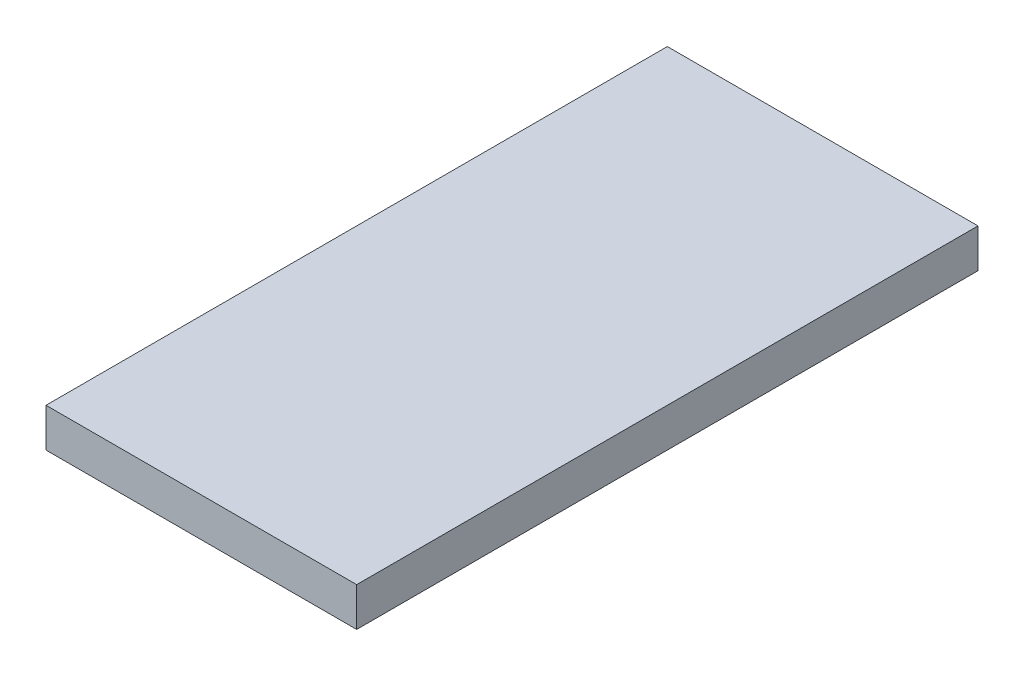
ISO-10303-21;
HEADER;
FILE_DESCRIPTION(('STEP AP214'),'2;1');
FILE_NAME('part.step','',(''),(''),'','','');
FILE_SCHEMA(('AUTOMOTIVE_DESIGN { 1 0 10303 214 1 1 1 1 }'));
ENDSEC;
DATA;
#1=APPLICATION_CONTEXT('core data for automotive mechanical design processes');
#2=APPLICATION_PROTOCOL_DEFINITION('international standard','automotive_design',2000,#1);
#3=PRODUCT_CONTEXT('',#1,'mechanical');
#4=PRODUCT('Part','Part','',(#3));
#5=PRODUCT_RELATED_PRODUCT_CATEGORY('part','',(#4));
#6=PRODUCT_DEFINITION_FORMATION('','',#4);
#7=PRODUCT_DEFINITION_CONTEXT('part definition',#1,'design');
#8=PRODUCT_DEFINITION('design','',#6,#7);
#9=PRODUCT_DEFINITION_SHAPE('','',#8);
#10=(LENGTH_UNIT() NAMED_UNIT(*) SI_UNIT(.MILLI.,.METRE.));
#11=(NAMED_UNIT(*) PLANE_ANGLE_UNIT() SI_UNIT($,.RADIAN.));
#12=(NAMED_UNIT(*) SI_UNIT($,.STERADIAN.) SOLID_ANGLE_UNIT());
#13=UNCERTAINTY_MEASURE_WITH_UNIT(LENGTH_MEASURE(1.E-05),#10,'distance_accuracy_value','');
#14=(GEOMETRIC_REPRESENTATION_CONTEXT(3) GLOBAL_UNCERTAINTY_ASSIGNED_CONTEXT((#13)) GLOBAL_UNIT_ASSIGNED_CONTEXT((#10,
#11,#12)) REPRESENTATION_CONTEXT('',''));
#15=CARTESIAN_POINT('',(0.,0.,0.));
#16=DIRECTION('',(0.,0.,1.));
#17=DIRECTION('',(1.,0.,0.));
#18=AXIS2_PLACEMENT_3D('',#15,#16,#17);
#19=CARTESIAN_POINT('',(-100.,25.,200.));
#20=DIRECTION('',(1.,0.,0.));
#21=DIRECTION('',(0.,1.,0.));
#22=AXIS2_PLACEMENT_3D('',#19,#20,#21);
#23=PLANE('',#22);
#24=DIRECTION('',(0.,-1.,0.));
#25=VECTOR('',#24,1.);
#26=CARTESIAN_POINT('',(-100.,25.,-200.));
#27=LINE('',#26,#25);
#28=CARTESIAN_POINT('',(-100.,25.,-200.));
#29=VERTEX_POINT('',#28);
#30=CARTESIAN_POINT('',(-100.,0.,-200.));
#31=VERTEX_POINT('',#30);
#32=EDGE_CURVE('E392',#29,#31,#27,.T.);
#33=ORIENTED_EDGE('',*,*,#32,.T.);
#34=DIRECTION('',(0.,0.,-1.));
#35=VECTOR('',#34,1.);
#36=CARTESIAN_POINT('',(-100.,0.,200.));
#37=LINE('',#36,#35);
#38=CARTESIAN_POINT('',(-100.,0.,200.));
#39=VERTEX_POINT('',#38);
#40=EDGE_CURVE('E11',#39,#31,#37,.T.);
#41=ORIENTED_EDGE('',*,*,#40,.F.);
#42=DIRECTION('',(0.,-1.,0.));
#43=VECTOR('',#42,1.);
#44=CARTESIAN_POINT('',(-100.,25.,200.));
#45=LINE('',#44,#43);
#46=CARTESIAN_POINT('',(-100.,25.,200.));
#47=VERTEX_POINT('',#46);
#48=EDGE_CURVE('E410',#47,#39,#45,.T.);
#49=ORIENTED_EDGE('',*,*,#48,.F.);
#50=DIRECTION('',(0.,0.,-1.));
#51=VECTOR('',#50,1.);
#52=CARTESIAN_POINT('',(-100.,25.,200.));
#53=LINE('',#52,#51);
#54=EDGE_CURVE('E404',#47,#29,#53,.T.);
#55=ORIENTED_EDGE('',*,*,#54,.T.);
#56=EDGE_LOOP('',(#33,#41,#49,#55));
#57=FACE_BOUND('',#56,.T.);
#58=ADVANCED_FACE('F348',(#57),#23,.F.);
#59=CARTESIAN_POINT('',(-100.,0.,200.));
#60=DIRECTION('',(0.,1.,0.));
#61=DIRECTION('',(0.,0.,1.));
#62=AXIS2_PLACEMENT_3D('',#59,#60,#61);
#63=PLANE('',#62);
#64=DIRECTION('',(1.,0.,0.));
#65=VECTOR('',#64,1.);
#66=CARTESIAN_POINT('',(-100.,0.,-200.));
#67=LINE('',#66,#65);
#68=CARTESIAN_POINT('',(100.,0.,-200.));
#69=VERTEX_POINT('',#68);
#70=EDGE_CURVE('E388',#31,#69,#67,.T.);
#71=ORIENTED_EDGE('',*,*,#70,.T.);
#72=DIRECTION('',(0.,0.,-1.));
#73=VECTOR('',#72,1.);
#74=CARTESIAN_POINT('',(100.,0.,200.));
#75=LINE('',#74,#73);
#76=CARTESIAN_POINT('',(100.,0.,200.));
#77=VERTEX_POINT('',#76);
#78=EDGE_CURVE('E355',#77,#69,#75,.T.);
#79=ORIENTED_EDGE('',*,*,#78,.F.);
#80=DIRECTION('',(1.,0.,0.));
#81=VECTOR('',#80,1.);
#82=CARTESIAN_POINT('',(-100.,0.,200.));
#83=LINE('',#82,#81);
#84=EDGE_CURVE('E400',#39,#77,#83,.T.);
#85=ORIENTED_EDGE('',*,*,#84,.F.);
#86=ORIENTED_EDGE('',*,*,#40,.T.);
#87=EDGE_LOOP('',(#71,#79,#85,#86));
#88=FACE_BOUND('',#87,.T.);
#89=ADVANCED_FACE('F399',(#88),#63,.F.);
#90=CARTESIAN_POINT('',(100.,25.,200.));
#91=DIRECTION('',(-1.,0.,0.));
#92=DIRECTION('',(0.,-1.,0.));
#93=AXIS2_PLACEMENT_3D('',#90,#91,#92);
#94=PLANE('',#93);
#95=DIRECTION('',(0.,1.,0.));
#96=VECTOR('',#95,1.);
#97=CARTESIAN_POINT('',(100.,25.,-200.));
#98=LINE('',#97,#96);
#99=CARTESIAN_POINT('',(100.,25.,-200.));
#100=VERTEX_POINT('',#99);
#101=EDGE_CURVE('E393',#69,#100,#98,.T.);
#102=ORIENTED_EDGE('',*,*,#101,.T.);
#103=DIRECTION('',(0.,0.,-1.));
#104=VECTOR('',#103,1.);
#105=CARTESIAN_POINT('',(100.,25.,200.));
#106=LINE('',#105,#104);
#107=CARTESIAN_POINT('',(100.,25.,200.));
#108=VERTEX_POINT('',#107);
#109=EDGE_CURVE('E416',#108,#100,#106,.T.);
#110=ORIENTED_EDGE('',*,*,#109,.F.);
#111=DIRECTION('',(0.,1.,0.));
#112=VECTOR('',#111,1.);
#113=CARTESIAN_POINT('',(100.,25.,200.));
#114=LINE('',#113,#112);
#115=EDGE_CURVE('E367',#77,#108,#114,.T.);
#116=ORIENTED_EDGE('',*,*,#115,.F.);
#117=ORIENTED_EDGE('',*,*,#78,.T.);
#118=EDGE_LOOP('',(#102,#110,#116,#117));
#119=FACE_BOUND('',#118,.T.);
#120=ADVANCED_FACE('F419',(#119),#94,.F.);
#121=CARTESIAN_POINT('',(-100.,25.,200.));
#122=DIRECTION('',(0.,-1.,0.));
#123=DIRECTION('',(1.,0.,0.));
#124=AXIS2_PLACEMENT_3D('',#121,#122,#123);
#125=PLANE('',#124);
#126=DIRECTION('',(-1.,0.,0.));
#127=VECTOR('',#126,1.);
#128=CARTESIAN_POINT('',(-100.,25.,-200.));
#129=LINE('',#128,#127);
#130=EDGE_CURVE('E408',#100,#29,#129,.T.);
#131=ORIENTED_EDGE('',*,*,#130,.T.);
#132=ORIENTED_EDGE('',*,*,#54,.F.);
#133=DIRECTION('',(-1.,0.,0.));
#134=VECTOR('',#133,1.);
#135=CARTESIAN_POINT('',(-100.,25.,200.));
#136=LINE('',#135,#134);
#137=EDGE_CURVE('E362',#108,#47,#136,.T.);
#138=ORIENTED_EDGE('',*,*,#137,.F.);
#139=ORIENTED_EDGE('',*,*,#109,.T.);
#140=EDGE_LOOP('',(#131,#132,#138,#139));
#141=FACE_BOUND('',#140,.T.);
#142=ADVANCED_FACE('F421',(#141),#125,.F.);
#143=CARTESIAN_POINT('',(-100.,25.,200.));
#144=DIRECTION('',(0.,0.,1.));
#145=DIRECTION('',(1.,0.,0.));
#146=AXIS2_PLACEMENT_3D('',#143,#144,#145);
#147=PLANE('',#146);
#148=ORIENTED_EDGE('',*,*,#48,.T.);
#149=ORIENTED_EDGE('',*,*,#84,.T.);
#150=ORIENTED_EDGE('',*,*,#115,.T.);
#151=ORIENTED_EDGE('',*,*,#137,.T.);
#152=EDGE_LOOP('',(#148,#149,#150,#151));
#153=FACE_BOUND('',#152,.T.);
#154=ADVANCED_FACE('F422',(#153),#147,.T.);
#155=CARTESIAN_POINT('',(-100.,25.,-200.));
#156=DIRECTION('',(0.,0.,1.));
#157=DIRECTION('',(1.,0.,0.));
#158=AXIS2_PLACEMENT_3D('',#155,#156,#157);
#159=PLANE('',#158);
#160=ORIENTED_EDGE('',*,*,#32,.F.);
#161=ORIENTED_EDGE('',*,*,#130,.F.);
#162=ORIENTED_EDGE('',*,*,#101,.F.);
#163=ORIENTED_EDGE('',*,*,#70,.F.);
#164=EDGE_LOOP('',(#160,#161,#162,#163));
#165=FACE_BOUND('',#164,.T.);
#166=ADVANCED_FACE('F389',(#165),#159,.F.);
#167=CLOSED_SHELL('',(#58,#89,#120,#142,#154,#166));
#168=MANIFOLD_SOLID_BREP('B2',#167);
#169=ADVANCED_BREP_SHAPE_REPRESENTATION('',(#18,#168),#14);
#170=SHAPE_DEFINITION_REPRESENTATION(#9,#169);
ENDSEC;
END-ISO-10303-21;
